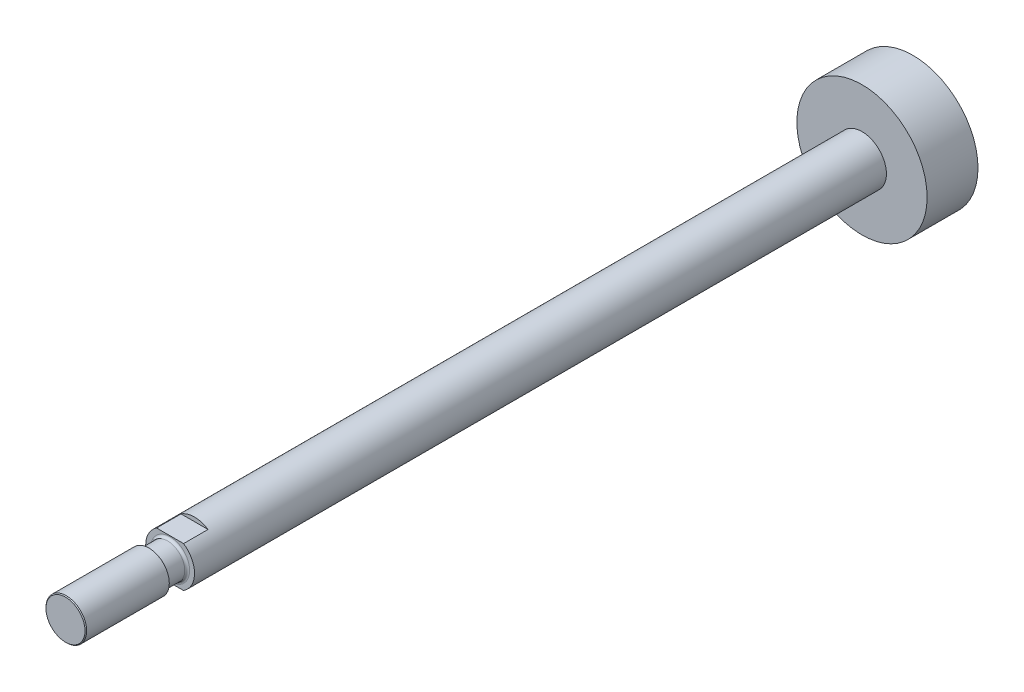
ISO-10303-21;
HEADER;
FILE_DESCRIPTION(('STEP AP214'),'2;1');
FILE_NAME('part.step','',(''),(''),'','','');
FILE_SCHEMA(('AUTOMOTIVE_DESIGN { 1 0 10303 214 1 1 1 1 }'));
ENDSEC;
DATA;
#1=APPLICATION_CONTEXT('core data for automotive mechanical design processes');
#2=APPLICATION_PROTOCOL_DEFINITION('international standard','automotive_design',2000,#1);
#3=PRODUCT_CONTEXT('',#1,'mechanical');
#4=PRODUCT('Part','Part','',(#3));
#5=PRODUCT_RELATED_PRODUCT_CATEGORY('part','',(#4));
#6=PRODUCT_DEFINITION_FORMATION('','',#4);
#7=PRODUCT_DEFINITION_CONTEXT('part definition',#1,'design');
#8=PRODUCT_DEFINITION('design','',#6,#7);
#9=PRODUCT_DEFINITION_SHAPE('','',#8);
#10=(LENGTH_UNIT() NAMED_UNIT(*) SI_UNIT(.MILLI.,.METRE.));
#11=(NAMED_UNIT(*) PLANE_ANGLE_UNIT() SI_UNIT($,.RADIAN.));
#12=(NAMED_UNIT(*) SI_UNIT($,.STERADIAN.) SOLID_ANGLE_UNIT());
#13=UNCERTAINTY_MEASURE_WITH_UNIT(LENGTH_MEASURE(1.E-05),#10,'distance_accuracy_value','');
#14=(GEOMETRIC_REPRESENTATION_CONTEXT(3) GLOBAL_UNCERTAINTY_ASSIGNED_CONTEXT((#13)) GLOBAL_UNIT_ASSIGNED_CONTEXT((#10,
#11,#12)) REPRESENTATION_CONTEXT('',''));
#15=CARTESIAN_POINT('',(0.,0.,0.));
#16=DIRECTION('',(0.,0.,1.));
#17=DIRECTION('',(1.,0.,0.));
#18=AXIS2_PLACEMENT_3D('',#15,#16,#17);
#19=CARTESIAN_POINT('',(0.,0.,176.25));
#20=DIRECTION('',(0.,0.,1.));
#21=DIRECTION('',(1.,0.,0.));
#22=AXIS2_PLACEMENT_3D('',#19,#20,#21);
#23=PLANE('',#22);
#24=CARTESIAN_POINT('',(0.,0.,176.25));
#25=DIRECTION('',(0.,0.,1.));
#26=DIRECTION('',(1.,0.,0.));
#27=AXIS2_PLACEMENT_3D('',#24,#25,#26);
#28=CIRCLE('',#27,4.8);
#29=CARTESIAN_POINT('',(4.8,0.,176.25));
#30=VERTEX_POINT('',#29);
#31=EDGE_CURVE('E99',#30,#30,#28,.F.);
#32=ORIENTED_EDGE('',*,*,#31,.T.);
#33=EDGE_LOOP('',(#32));
#34=FACE_BOUND('',#33,.T.);
#35=DIRECTION('',(-1.,0.,0.));
#36=VECTOR('',#35,1.);
#37=CARTESIAN_POINT('',(0.,-5.,176.25));
#38=LINE('',#37,#36);
#39=CARTESIAN_POINT('',(3.31662479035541,-5.,176.25));
#40=VERTEX_POINT('',#39);
#41=CARTESIAN_POINT('',(-3.31662479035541,-5.,176.25));
#42=VERTEX_POINT('',#41);
#43=EDGE_CURVE('E55',#40,#42,#38,.T.);
#44=ORIENTED_EDGE('',*,*,#43,.F.);
#45=CARTESIAN_POINT('',(0.,0.,176.25));
#46=DIRECTION('',(0.,0.,1.));
#47=DIRECTION('',(1.,0.,0.));
#48=AXIS2_PLACEMENT_3D('',#45,#46,#47);
#49=CIRCLE('',#48,6.);
#50=CARTESIAN_POINT('',(3.31662479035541,5.,176.25));
#51=VERTEX_POINT('',#50);
#52=EDGE_CURVE('E76',#40,#51,#49,.T.);
#53=ORIENTED_EDGE('',*,*,#52,.T.);
#54=DIRECTION('',(1.,0.,0.));
#55=VECTOR('',#54,1.);
#56=CARTESIAN_POINT('',(0.,5.,176.25));
#57=LINE('',#56,#55);
#58=CARTESIAN_POINT('',(-3.31662479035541,5.,176.25));
#59=VERTEX_POINT('',#58);
#60=EDGE_CURVE('E74',#59,#51,#57,.T.);
#61=ORIENTED_EDGE('',*,*,#60,.F.);
#62=EDGE_CURVE('E71',#59,#42,#49,.T.);
#63=ORIENTED_EDGE('',*,*,#62,.T.);
#64=EDGE_LOOP('',(#44,#53,#61,#63));
#65=FACE_BOUND('',#64,.T.);
#66=ADVANCED_FACE('F14',(#34,#65),#23,.T.);
#67=CARTESIAN_POINT('',(0.,0.,6.25));
#68=DIRECTION('',(0.,0.,1.));
#69=DIRECTION('',(1.,0.,0.));
#70=AXIS2_PLACEMENT_3D('',#67,#68,#69);
#71=PLANE('',#70);
#72=CARTESIAN_POINT('',(0.,0.,6.25));
#73=DIRECTION('',(0.,0.,1.));
#74=DIRECTION('',(1.,0.,0.));
#75=AXIS2_PLACEMENT_3D('',#72,#73,#74);
#76=CIRCLE('',#75,16.);
#77=CARTESIAN_POINT('',(16.,0.,6.25));
#78=VERTEX_POINT('',#77);
#79=EDGE_CURVE('E79',#78,#78,#76,.T.);
#80=ORIENTED_EDGE('',*,*,#79,.T.);
#81=EDGE_LOOP('',(#80));
#82=FACE_BOUND('',#81,.T.);
#83=CARTESIAN_POINT('',(0.,0.,6.25));
#84=DIRECTION('',(0.,0.,1.));
#85=DIRECTION('',(1.,0.,0.));
#86=AXIS2_PLACEMENT_3D('',#83,#84,#85);
#87=CIRCLE('',#86,6.);
#88=CARTESIAN_POINT('',(6.,0.,6.25));
#89=VERTEX_POINT('',#88);
#90=EDGE_CURVE('E81',#89,#89,#87,.T.);
#91=ORIENTED_EDGE('',*,*,#90,.F.);
#92=EDGE_LOOP('',(#91));
#93=FACE_BOUND('',#92,.T.);
#94=ADVANCED_FACE('F120',(#82,#93),#71,.T.);
#95=CARTESIAN_POINT('',(0.,0.,6.25));
#96=DIRECTION('',(0.,0.,-1.));
#97=DIRECTION('',(-1.,0.,0.));
#98=AXIS2_PLACEMENT_3D('',#95,#96,#97);
#99=CYLINDRICAL_SURFACE('',#98,16.);
#100=ORIENTED_EDGE('',*,*,#79,.F.);
#101=EDGE_LOOP('',(#100));
#102=FACE_BOUND('',#101,.T.);
#103=CARTESIAN_POINT('',(0.,0.,-6.25));
#104=DIRECTION('',(0.,0.,1.));
#105=DIRECTION('',(1.,0.,0.));
#106=AXIS2_PLACEMENT_3D('',#103,#104,#105);
#107=CIRCLE('',#106,16.);
#108=CARTESIAN_POINT('',(16.,0.,-6.25));
#109=VERTEX_POINT('',#108);
#110=EDGE_CURVE('E75',#109,#109,#107,.T.);
#111=ORIENTED_EDGE('',*,*,#110,.T.);
#112=EDGE_LOOP('',(#111));
#113=FACE_BOUND('',#112,.T.);
#114=ADVANCED_FACE('F16',(#102,#113),#99,.T.);
#115=CARTESIAN_POINT('',(0.,0.,-6.25));
#116=DIRECTION('',(0.,0.,1.));
#117=DIRECTION('',(1.,0.,0.));
#118=AXIS2_PLACEMENT_3D('',#115,#116,#117);
#119=PLANE('',#118);
#120=ORIENTED_EDGE('',*,*,#110,.F.);
#121=EDGE_LOOP('',(#120));
#122=FACE_BOUND('',#121,.T.);
#123=ADVANCED_FACE('F134',(#122),#119,.F.);
#124=CARTESIAN_POINT('',(0.,0.,176.25));
#125=DIRECTION('',(0.,0.,-1.));
#126=DIRECTION('',(-1.,0.,0.));
#127=AXIS2_PLACEMENT_3D('',#124,#125,#126);
#128=CYLINDRICAL_SURFACE('',#127,6.);
#129=ORIENTED_EDGE('',*,*,#52,.F.);
#130=DIRECTION('',(0.,0.,-1.));
#131=VECTOR('',#130,1.);
#132=CARTESIAN_POINT('',(3.31662479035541,-5.,176.25));
#133=LINE('',#132,#131);
#134=CARTESIAN_POINT('',(3.31662479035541,-5.,170.25));
#135=VERTEX_POINT('',#134);
#136=EDGE_CURVE('E29',#40,#135,#133,.T.);
#137=ORIENTED_EDGE('',*,*,#136,.T.);
#138=CARTESIAN_POINT('',(0.,0.,170.25));
#139=DIRECTION('',(0.,0.,-1.));
#140=DIRECTION('',(-1.,0.,0.));
#141=AXIS2_PLACEMENT_3D('',#138,#139,#140);
#142=CIRCLE('',#141,6.);
#143=CARTESIAN_POINT('',(-3.31662479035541,-5.,170.25));
#144=VERTEX_POINT('',#143);
#145=EDGE_CURVE('E63',#135,#144,#142,.T.);
#146=ORIENTED_EDGE('',*,*,#145,.T.);
#147=DIRECTION('',(0.,0.,-1.));
#148=VECTOR('',#147,1.);
#149=CARTESIAN_POINT('',(-3.31662479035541,-5.,176.25));
#150=LINE('',#149,#148);
#151=EDGE_CURVE('E58',#144,#42,#150,.F.);
#152=ORIENTED_EDGE('',*,*,#151,.T.);
#153=ORIENTED_EDGE('',*,*,#62,.F.);
#154=DIRECTION('',(0.,0.,-1.));
#155=VECTOR('',#154,1.);
#156=CARTESIAN_POINT('',(-3.31662479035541,5.,176.25));
#157=LINE('',#156,#155);
#158=CARTESIAN_POINT('',(-3.31662479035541,5.,170.25));
#159=VERTEX_POINT('',#158);
#160=EDGE_CURVE('E37',#59,#159,#157,.T.);
#161=ORIENTED_EDGE('',*,*,#160,.T.);
#162=CARTESIAN_POINT('',(0.,0.,170.25));
#163=DIRECTION('',(0.,0.,1.));
#164=DIRECTION('',(1.,0.,0.));
#165=AXIS2_PLACEMENT_3D('',#162,#163,#164);
#166=CIRCLE('',#165,6.);
#167=CARTESIAN_POINT('',(3.31662479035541,5.,170.25));
#168=VERTEX_POINT('',#167);
#169=EDGE_CURVE('E64',#168,#159,#166,.T.);
#170=ORIENTED_EDGE('',*,*,#169,.F.);
#171=DIRECTION('',(0.,0.,-1.));
#172=VECTOR('',#171,1.);
#173=CARTESIAN_POINT('',(3.31662479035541,5.,176.25));
#174=LINE('',#173,#172);
#175=EDGE_CURVE('E149',#168,#51,#174,.F.);
#176=ORIENTED_EDGE('',*,*,#175,.T.);
#177=EDGE_LOOP('',(#129,#137,#146,#152,#153,#161,#170,#176));
#178=FACE_BOUND('',#177,.T.);
#179=ORIENTED_EDGE('',*,*,#90,.T.);
#180=EDGE_LOOP('',(#179));
#181=FACE_BOUND('',#180,.T.);
#182=ADVANCED_FACE('F69',(#178,#181),#128,.T.);
#183=CARTESIAN_POINT('',(0.,0.,170.25));
#184=DIRECTION('',(0.,0.,1.));
#185=DIRECTION('',(1.,0.,0.));
#186=AXIS2_PLACEMENT_3D('',#183,#184,#185);
#187=PLANE('',#186);
#188=ORIENTED_EDGE('',*,*,#169,.T.);
#189=DIRECTION('',(1.,0.,0.));
#190=VECTOR('',#189,1.);
#191=CARTESIAN_POINT('',(15.1986841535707,5.,170.25));
#192=LINE('',#191,#190);
#193=EDGE_CURVE('E152',#159,#168,#192,.T.);
#194=ORIENTED_EDGE('',*,*,#193,.T.);
#195=EDGE_LOOP('',(#188,#194));
#196=FACE_BOUND('',#195,.T.);
#197=ADVANCED_FACE('F133',(#196),#187,.T.);
#198=CARTESIAN_POINT('',(15.1986841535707,5.,170.25));
#199=DIRECTION('',(0.,-1.,0.));
#200=DIRECTION('',(0.,0.,-1.));
#201=AXIS2_PLACEMENT_3D('',#198,#199,#200);
#202=PLANE('',#201);
#203=ORIENTED_EDGE('',*,*,#60,.T.);
#204=ORIENTED_EDGE('',*,*,#175,.F.);
#205=ORIENTED_EDGE('',*,*,#193,.F.);
#206=ORIENTED_EDGE('',*,*,#160,.F.);
#207=EDGE_LOOP('',(#203,#204,#205,#206));
#208=FACE_BOUND('',#207,.T.);
#209=ADVANCED_FACE('F129',(#208),#202,.F.);
#210=CARTESIAN_POINT('',(0.,0.,170.25));
#211=DIRECTION('',(0.,0.,-1.));
#212=DIRECTION('',(-1.,0.,0.));
#213=AXIS2_PLACEMENT_3D('',#210,#211,#212);
#214=PLANE('',#213);
#215=DIRECTION('',(-1.,0.,0.));
#216=VECTOR('',#215,1.);
#217=CARTESIAN_POINT('',(15.1986841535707,-5.,170.25));
#218=LINE('',#217,#216);
#219=EDGE_CURVE('E72',#135,#144,#218,.T.);
#220=ORIENTED_EDGE('',*,*,#219,.T.);
#221=ORIENTED_EDGE('',*,*,#145,.F.);
#222=EDGE_LOOP('',(#220,#221));
#223=FACE_BOUND('',#222,.T.);
#224=ADVANCED_FACE('F182',(#223),#214,.F.);
#225=CARTESIAN_POINT('',(15.1986841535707,-5.,170.25));
#226=DIRECTION('',(0.,1.,0.));
#227=DIRECTION('',(0.,0.,1.));
#228=AXIS2_PLACEMENT_3D('',#225,#226,#227);
#229=PLANE('',#228);
#230=ORIENTED_EDGE('',*,*,#43,.T.);
#231=ORIENTED_EDGE('',*,*,#151,.F.);
#232=ORIENTED_EDGE('',*,*,#219,.F.);
#233=ORIENTED_EDGE('',*,*,#136,.F.);
#234=EDGE_LOOP('',(#230,#231,#232,#233));
#235=FACE_BOUND('',#234,.T.);
#236=ADVANCED_FACE('F57',(#235),#229,.F.);
#237=CARTESIAN_POINT('',(0.,0.,181.45));
#238=DIRECTION('',(0.,0.,-1.));
#239=DIRECTION('',(-1.,0.,0.));
#240=AXIS2_PLACEMENT_3D('',#237,#238,#239);
#241=CYLINDRICAL_SURFACE('',#240,4.2);
#242=CARTESIAN_POINT('',(0.,0.,180.85));
#243=DIRECTION('',(0.,0.,1.));
#244=DIRECTION('',(1.,0.,0.));
#245=AXIS2_PLACEMENT_3D('',#242,#243,#244);
#246=CIRCLE('',#245,4.2);
#247=CARTESIAN_POINT('',(4.2,0.,180.85));
#248=VERTEX_POINT('',#247);
#249=EDGE_CURVE('E96',#248,#248,#246,.F.);
#250=ORIENTED_EDGE('',*,*,#249,.T.);
#251=EDGE_LOOP('',(#250));
#252=FACE_BOUND('',#251,.T.);
#253=CARTESIAN_POINT('',(0.,0.,176.85));
#254=DIRECTION('',(0.,0.,1.));
#255=DIRECTION('',(1.,0.,0.));
#256=AXIS2_PLACEMENT_3D('',#253,#254,#255);
#257=CIRCLE('',#256,4.2);
#258=CARTESIAN_POINT('',(4.2,0.,176.85));
#259=VERTEX_POINT('',#258);
#260=EDGE_CURVE('E93',#259,#259,#257,.T.);
#261=ORIENTED_EDGE('',*,*,#260,.T.);
#262=EDGE_LOOP('',(#261));
#263=FACE_BOUND('',#262,.T.);
#264=ADVANCED_FACE('F167',(#252,#263),#241,.T.);
#265=CARTESIAN_POINT('',(0.,0.,181.45));
#266=DIRECTION('',(0.,0.,1.));
#267=DIRECTION('',(1.,0.,0.));
#268=AXIS2_PLACEMENT_3D('',#265,#266,#267);
#269=PLANE('',#268);
#270=CARTESIAN_POINT('',(0.,0.,181.45));
#271=DIRECTION('',(0.,0.,1.));
#272=DIRECTION('',(1.,0.,0.));
#273=AXIS2_PLACEMENT_3D('',#270,#271,#272);
#274=CIRCLE('',#273,4.8);
#275=CARTESIAN_POINT('',(4.8,0.,181.45));
#276=VERTEX_POINT('',#275);
#277=EDGE_CURVE('E90',#276,#276,#274,.T.);
#278=ORIENTED_EDGE('',*,*,#277,.T.);
#279=EDGE_LOOP('',(#278));
#280=FACE_BOUND('',#279,.T.);
#281=CARTESIAN_POINT('',(0.,0.,181.45));
#282=DIRECTION('',(0.,0.,1.));
#283=DIRECTION('',(1.,0.,0.));
#284=AXIS2_PLACEMENT_3D('',#281,#282,#283);
#285=CIRCLE('',#284,5.);
#286=CARTESIAN_POINT('',(5.,0.,181.45));
#287=VERTEX_POINT('',#286);
#288=EDGE_CURVE('E159',#287,#287,#285,.T.);
#289=ORIENTED_EDGE('',*,*,#288,.F.);
#290=EDGE_LOOP('',(#289));
#291=FACE_BOUND('',#290,.T.);
#292=ADVANCED_FACE('F165',(#280,#291),#269,.F.);
#293=CARTESIAN_POINT('',(0.,0.,201.95));
#294=DIRECTION('',(0.,0.,-1.));
#295=DIRECTION('',(-1.,0.,0.));
#296=AXIS2_PLACEMENT_3D('',#293,#294,#295);
#297=CYLINDRICAL_SURFACE('',#296,5.);
#298=CARTESIAN_POINT('',(0.,0.,201.75));
#299=DIRECTION('',(0.,0.,1.));
#300=DIRECTION('',(1.,0.,0.));
#301=AXIS2_PLACEMENT_3D('',#298,#299,#300);
#302=CIRCLE('',#301,5.);
#303=CARTESIAN_POINT('',(5.,0.,201.75));
#304=VERTEX_POINT('',#303);
#305=EDGE_CURVE('E9',#304,#304,#302,.F.);
#306=ORIENTED_EDGE('',*,*,#305,.T.);
#307=EDGE_LOOP('',(#306));
#308=FACE_BOUND('',#307,.T.);
#309=ORIENTED_EDGE('',*,*,#288,.T.);
#310=EDGE_LOOP('',(#309));
#311=FACE_BOUND('',#310,.T.);
#312=ADVANCED_FACE('F163',(#308,#311),#297,.T.);
#313=CARTESIAN_POINT('',(0.,0.,201.95));
#314=DIRECTION('',(0.,0.,1.));
#315=DIRECTION('',(1.,0.,0.));
#316=AXIS2_PLACEMENT_3D('',#313,#314,#315);
#317=PLANE('',#316);
#318=CARTESIAN_POINT('',(0.,0.,201.95));
#319=DIRECTION('',(0.,0.,1.));
#320=DIRECTION('',(1.,0.,0.));
#321=AXIS2_PLACEMENT_3D('',#318,#319,#320);
#322=CIRCLE('',#321,4.8);
#323=CARTESIAN_POINT('',(4.8,0.,201.95));
#324=VERTEX_POINT('',#323);
#325=EDGE_CURVE('E22',#324,#324,#322,.T.);
#326=ORIENTED_EDGE('',*,*,#325,.T.);
#327=EDGE_LOOP('',(#326));
#328=FACE_BOUND('',#327,.T.);
#329=ADVANCED_FACE('F104',(#328),#317,.T.);
#330=CARTESIAN_POINT('',(0.,0.,180.85));
#331=DIRECTION('',(0.,0.,1.));
#332=DIRECTION('',(1.,0.,0.));
#333=AXIS2_PLACEMENT_3D('',#330,#331,#332);
#334=TOROIDAL_SURFACE('',#333,4.8,0.6);
#335=ORIENTED_EDGE('',*,*,#249,.F.);
#336=EDGE_LOOP('',(#335));
#337=FACE_BOUND('',#336,.T.);
#338=ORIENTED_EDGE('',*,*,#277,.F.);
#339=EDGE_LOOP('',(#338));
#340=FACE_BOUND('',#339,.T.);
#341=ADVANCED_FACE('F115',(#337,#340),#334,.F.);
#342=CARTESIAN_POINT('',(0.,0.,176.85));
#343=DIRECTION('',(0.,0.,1.));
#344=DIRECTION('',(1.,0.,0.));
#345=AXIS2_PLACEMENT_3D('',#342,#343,#344);
#346=TOROIDAL_SURFACE('',#345,4.8,0.6);
#347=ORIENTED_EDGE('',*,*,#31,.F.);
#348=EDGE_LOOP('',(#347));
#349=FACE_BOUND('',#348,.T.);
#350=ORIENTED_EDGE('',*,*,#260,.F.);
#351=EDGE_LOOP('',(#350));
#352=FACE_BOUND('',#351,.T.);
#353=ADVANCED_FACE('F108',(#349,#352),#346,.F.);
#354=CARTESIAN_POINT('',(0.,0.,201.95));
#355=DIRECTION('',(0.,0.,-1.));
#356=DIRECTION('',(-1.,0.,0.));
#357=AXIS2_PLACEMENT_3D('',#354,#355,#356);
#358=CONICAL_SURFACE('',#357,4.8,0.785398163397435);
#359=ORIENTED_EDGE('',*,*,#305,.F.);
#360=EDGE_LOOP('',(#359));
#361=FACE_BOUND('',#360,.T.);
#362=ORIENTED_EDGE('',*,*,#325,.F.);
#363=EDGE_LOOP('',(#362));
#364=FACE_BOUND('',#363,.T.);
#365=ADVANCED_FACE('F106',(#361,#364),#358,.T.);
#366=CLOSED_SHELL('',(#66,#94,#114,#123,#182,#197,#209,#224,#236,#264,#292,#312,#329,#341,#353,#365));
#367=MANIFOLD_SOLID_BREP('B1',#366);
#368=ADVANCED_BREP_SHAPE_REPRESENTATION('',(#18,#367),#14);
#369=SHAPE_DEFINITION_REPRESENTATION(#9,#368);
ENDSEC;
END-ISO-10303-21;
